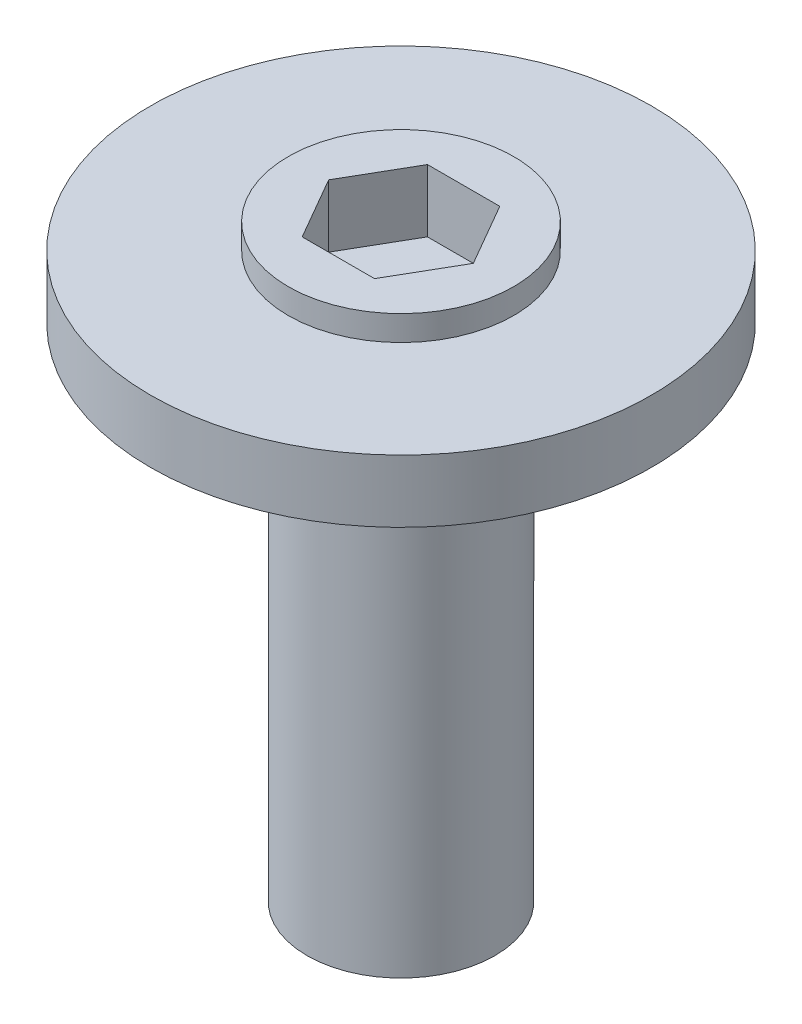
from build123d import *

# Parameters (mm, degrees)
SKETCH_1_R          = 4
SKETCH_1_R_2        = 1.8
EXTRUDE_1_DEPTH     = 1
SKETCH_1_3_R        = 1.8
EXTRUDE_2_DEPTH     = 1.4
CUT_EXTRUDE_START   = 1.4
CUT_EXTRUDE_1_DEPTH = 1
SKETCH_2_R          = 1.5
EXTRUDE_3_DEPTH     = 8


with BuildPart() as part:
    # Sketch 1 → Extrude 1 (new body)
    # profile 1 of 3: a face of its own
    with BuildSketch(Plane(origin=(0, 0, 0), x_dir=(1, 0, 0), z_dir=(0, 1, 0))):
        with Locations(Location((0, 0, 0), (0, 0, 270))):
            Circle(SKETCH_1_R)
        Circle(SKETCH_1_R_2, mode=Mode.SUBTRACT)
    # profile 2 of 3: a face of its own
    with BuildSketch(Plane(origin=(0, 0, 0), x_dir=(1, 0, 0), z_dir=(0, 1, 0))):
        Circle(SKETCH_1_R_2)
        Polygon((0.577350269, -1), (1.154700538, 0), (0.577350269, 1), (-0.577350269, 1), (-1.154700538, 0), (-0.577350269, -1), align=None, mode=Mode.SUBTRACT)
    # profile 3 of 3: a face of its own
    with BuildSketch(Plane(origin=(0, 0, 0), x_dir=(1, 0, 0), z_dir=(0, 1, 0))):
        Polygon((-0.577350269, -1), (0.577350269, -1), (1.154700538, 0), (0.577350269, 1), (-0.577350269, 1), (-1.154700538, 0), align=None)
    extrude(amount=EXTRUDE_1_DEPTH)

    # Sketch 1_3 → Extrude 2 (add)
    # profile 1 of 2: a face of its own
    with BuildSketch(Plane(origin=(0, 0, 0), x_dir=(1, 0, 0), z_dir=(0, 1, 0))):
        with Locations(Location((0, 0, 0), (0, 0, 270))):
            Circle(SKETCH_1_3_R)
        Polygon((0.577350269, -1), (1.154700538, 0), (0.577350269, 1), (-0.577350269, 1), (-1.154700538, 0), (-0.577350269, -1), align=None, mode=Mode.SUBTRACT)
    # profile 2 of 2: a face of its own
    with BuildSketch(Plane(origin=(0, 0, 0), x_dir=(1, 0, 0), z_dir=(0, 1, 0))):
        Polygon((-0.577350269, -1), (0.577350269, -1), (1.154700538, 0), (0.577350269, 1), (-0.577350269, 1), (-1.154700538, 0), align=None)
    extrude(amount=EXTRUDE_2_DEPTH)

    # Sketch 1_4 → Cut-Extrude 1 (cut)
    with BuildSketch(Plane(origin=(0, 0, 0), x_dir=(1, 0, 0), z_dir=(0, 1, 0)).offset(CUT_EXTRUDE_START)):
        Polygon((-0.577350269, -1), (0.577350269, -1), (1.154700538, 0), (0.577350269, 1), (-0.577350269, 1), (-1.154700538, 0), align=None)
    extrude(amount=-CUT_EXTRUDE_1_DEPTH, mode=Mode.SUBTRACT)

    # Sketch 2 → Extrude 3 (add)
    with BuildSketch(Plane.XZ):
        with Locations(Location((0, 0, 0), (0, 0, 90))):
            Circle(SKETCH_2_R)
    extrude(amount=EXTRUDE_3_DEPTH)


solid = part.part
